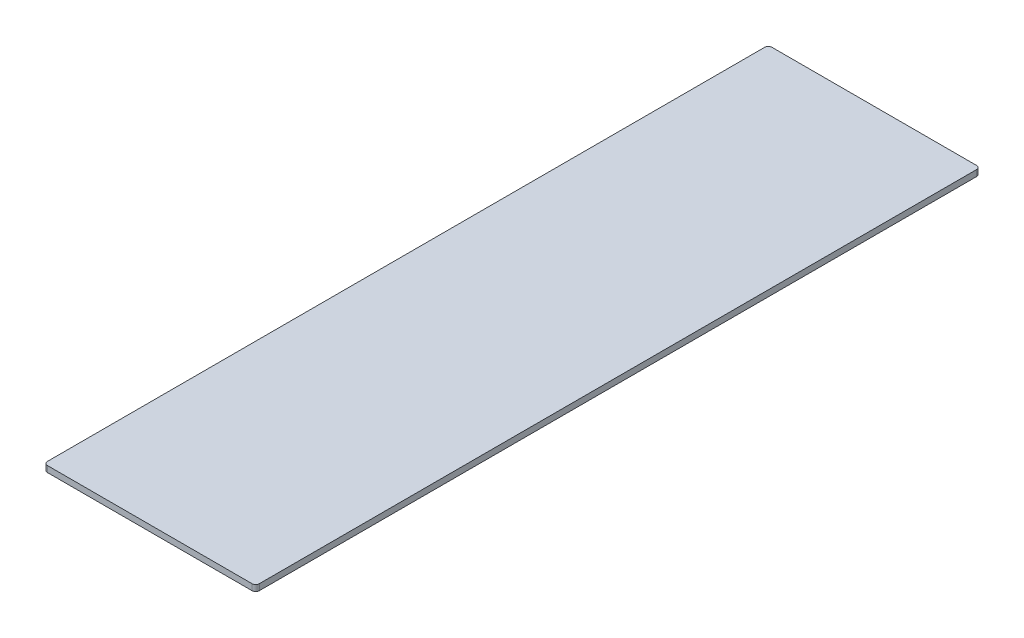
ISO-10303-21;
HEADER;
FILE_DESCRIPTION(('STEP AP214'),'2;1');
FILE_NAME('part.step','',(''),(''),'','','');
FILE_SCHEMA(('AUTOMOTIVE_DESIGN { 1 0 10303 214 1 1 1 1 }'));
ENDSEC;
DATA;
#1=APPLICATION_CONTEXT('core data for automotive mechanical design processes');
#2=APPLICATION_PROTOCOL_DEFINITION('international standard','automotive_design',2000,#1);
#3=PRODUCT_CONTEXT('',#1,'mechanical');
#4=PRODUCT('Part','Part','',(#3));
#5=PRODUCT_RELATED_PRODUCT_CATEGORY('part','',(#4));
#6=PRODUCT_DEFINITION_FORMATION('','',#4);
#7=PRODUCT_DEFINITION_CONTEXT('part definition',#1,'design');
#8=PRODUCT_DEFINITION('design','',#6,#7);
#9=PRODUCT_DEFINITION_SHAPE('','',#8);
#10=(LENGTH_UNIT() NAMED_UNIT(*) SI_UNIT(.MILLI.,.METRE.));
#11=(NAMED_UNIT(*) PLANE_ANGLE_UNIT() SI_UNIT($,.RADIAN.));
#12=(NAMED_UNIT(*) SI_UNIT($,.STERADIAN.) SOLID_ANGLE_UNIT());
#13=UNCERTAINTY_MEASURE_WITH_UNIT(LENGTH_MEASURE(1.E-05),#10,'distance_accuracy_value','');
#14=(GEOMETRIC_REPRESENTATION_CONTEXT(3) GLOBAL_UNCERTAINTY_ASSIGNED_CONTEXT((#13)) GLOBAL_UNIT_ASSIGNED_CONTEXT((#10,
#11,#12)) REPRESENTATION_CONTEXT('',''));
#15=CARTESIAN_POINT('',(0.,0.,0.));
#16=DIRECTION('',(0.,0.,1.));
#17=DIRECTION('',(1.,0.,0.));
#18=AXIS2_PLACEMENT_3D('',#15,#16,#17);
#19=CARTESIAN_POINT('',(-86.7,-5.,296.5));
#20=DIRECTION('',(-1.,0.,0.));
#21=DIRECTION('',(0.,0.,1.));
#22=AXIS2_PLACEMENT_3D('',#19,#20,#21);
#23=PLANE('',#22);
#24=DIRECTION('',(0.,0.,1.));
#25=VECTOR('',#24,1.);
#26=CARTESIAN_POINT('',(-86.7,0.,296.5));
#27=LINE('',#26,#25);
#28=CARTESIAN_POINT('',(-86.7,0.,-293.5));
#29=VERTEX_POINT('',#28);
#30=CARTESIAN_POINT('',(-86.7,0.,293.5));
#31=VERTEX_POINT('',#30);
#32=EDGE_CURVE('E158',#29,#31,#27,.T.);
#33=ORIENTED_EDGE('',*,*,#32,.F.);
#34=DIRECTION('',(0.,1.,0.));
#35=VECTOR('',#34,1.);
#36=CARTESIAN_POINT('',(-86.7,-5.,-293.5));
#37=LINE('',#36,#35);
#38=CARTESIAN_POINT('',(-86.7,-5.,-293.5));
#39=VERTEX_POINT('',#38);
#40=EDGE_CURVE('E148',#29,#39,#37,.F.);
#41=ORIENTED_EDGE('',*,*,#40,.T.);
#42=DIRECTION('',(0.,0.,1.));
#43=VECTOR('',#42,1.);
#44=CARTESIAN_POINT('',(-86.7,-5.,296.5));
#45=LINE('',#44,#43);
#46=CARTESIAN_POINT('',(-86.7,-5.,293.5));
#47=VERTEX_POINT('',#46);
#48=EDGE_CURVE('E152',#39,#47,#45,.T.);
#49=ORIENTED_EDGE('',*,*,#48,.T.);
#50=DIRECTION('',(0.,1.,0.));
#51=VECTOR('',#50,1.);
#52=CARTESIAN_POINT('',(-86.7,-5.,293.5));
#53=LINE('',#52,#51);
#54=EDGE_CURVE('E145',#47,#31,#53,.T.);
#55=ORIENTED_EDGE('',*,*,#54,.T.);
#56=EDGE_LOOP('',(#33,#41,#49,#55));
#57=FACE_BOUND('',#56,.T.);
#58=ADVANCED_FACE('F35',(#57),#23,.T.);
#59=CARTESIAN_POINT('',(86.7,-5.,-296.5));
#60=DIRECTION('',(0.,0.,-1.));
#61=DIRECTION('',(-1.,0.,0.));
#62=AXIS2_PLACEMENT_3D('',#59,#60,#61);
#63=PLANE('',#62);
#64=DIRECTION('',(-1.,0.,0.));
#65=VECTOR('',#64,1.);
#66=CARTESIAN_POINT('',(86.7,0.,-296.5));
#67=LINE('',#66,#65);
#68=CARTESIAN_POINT('',(83.7,0.,-296.5));
#69=VERTEX_POINT('',#68);
#70=CARTESIAN_POINT('',(-83.7,0.,-296.5));
#71=VERTEX_POINT('',#70);
#72=EDGE_CURVE('E118',#69,#71,#67,.T.);
#73=ORIENTED_EDGE('',*,*,#72,.F.);
#74=DIRECTION('',(0.,1.,0.));
#75=VECTOR('',#74,1.);
#76=CARTESIAN_POINT('',(83.7,-5.,-296.5));
#77=LINE('',#76,#75);
#78=CARTESIAN_POINT('',(83.7,-5.,-296.5));
#79=VERTEX_POINT('',#78);
#80=EDGE_CURVE('E136',#69,#79,#77,.F.);
#81=ORIENTED_EDGE('',*,*,#80,.T.);
#82=DIRECTION('',(-1.,0.,0.));
#83=VECTOR('',#82,1.);
#84=CARTESIAN_POINT('',(86.7,-5.,-296.5));
#85=LINE('',#84,#83);
#86=CARTESIAN_POINT('',(-83.7,-5.,-296.5));
#87=VERTEX_POINT('',#86);
#88=EDGE_CURVE('E120',#79,#87,#85,.T.);
#89=ORIENTED_EDGE('',*,*,#88,.T.);
#90=DIRECTION('',(0.,1.,0.));
#91=VECTOR('',#90,1.);
#92=CARTESIAN_POINT('',(-83.7,-5.,-296.5));
#93=LINE('',#92,#91);
#94=EDGE_CURVE('E133',#87,#71,#93,.T.);
#95=ORIENTED_EDGE('',*,*,#94,.T.);
#96=EDGE_LOOP('',(#73,#81,#89,#95));
#97=FACE_BOUND('',#96,.T.);
#98=ADVANCED_FACE('F176',(#97),#63,.T.);
#99=CARTESIAN_POINT('',(86.7,-5.,296.5));
#100=DIRECTION('',(1.,0.,0.));
#101=DIRECTION('',(0.,0.,-1.));
#102=AXIS2_PLACEMENT_3D('',#99,#100,#101);
#103=PLANE('',#102);
#104=DIRECTION('',(0.,0.,-1.));
#105=VECTOR('',#104,1.);
#106=CARTESIAN_POINT('',(86.7,-5.,296.5));
#107=LINE('',#106,#105);
#108=CARTESIAN_POINT('',(86.7,-5.,293.5));
#109=VERTEX_POINT('',#108);
#110=CARTESIAN_POINT('',(86.7,-5.,-293.5));
#111=VERTEX_POINT('',#110);
#112=EDGE_CURVE('E124',#109,#111,#107,.T.);
#113=ORIENTED_EDGE('',*,*,#112,.T.);
#114=DIRECTION('',(0.,1.,0.));
#115=VECTOR('',#114,1.);
#116=CARTESIAN_POINT('',(86.7,-5.,-293.5));
#117=LINE('',#116,#115);
#118=CARTESIAN_POINT('',(86.7,0.,-293.5));
#119=VERTEX_POINT('',#118);
#120=EDGE_CURVE('E110',#111,#119,#117,.T.);
#121=ORIENTED_EDGE('',*,*,#120,.T.);
#122=DIRECTION('',(0.,0.,-1.));
#123=VECTOR('',#122,1.);
#124=CARTESIAN_POINT('',(86.7,0.,296.5));
#125=LINE('',#124,#123);
#126=CARTESIAN_POINT('',(86.7,0.,293.5));
#127=VERTEX_POINT('',#126);
#128=EDGE_CURVE('E103',#127,#119,#125,.T.);
#129=ORIENTED_EDGE('',*,*,#128,.F.);
#130=DIRECTION('',(0.,1.,0.));
#131=VECTOR('',#130,1.);
#132=CARTESIAN_POINT('',(86.7,-5.,293.5));
#133=LINE('',#132,#131);
#134=EDGE_CURVE('E116',#127,#109,#133,.F.);
#135=ORIENTED_EDGE('',*,*,#134,.T.);
#136=EDGE_LOOP('',(#113,#121,#129,#135));
#137=FACE_BOUND('',#136,.T.);
#138=ADVANCED_FACE('F115',(#137),#103,.T.);
#139=CARTESIAN_POINT('',(86.7,-5.,296.5));
#140=DIRECTION('',(0.,0.,1.));
#141=DIRECTION('',(1.,0.,0.));
#142=AXIS2_PLACEMENT_3D('',#139,#140,#141);
#143=PLANE('',#142);
#144=DIRECTION('',(1.,0.,0.));
#145=VECTOR('',#144,1.);
#146=CARTESIAN_POINT('',(86.7,0.,296.5));
#147=LINE('',#146,#145);
#148=CARTESIAN_POINT('',(-83.7,0.,296.5));
#149=VERTEX_POINT('',#148);
#150=CARTESIAN_POINT('',(83.7,0.,296.5));
#151=VERTEX_POINT('',#150);
#152=EDGE_CURVE('E104',#149,#151,#147,.T.);
#153=ORIENTED_EDGE('',*,*,#152,.F.);
#154=DIRECTION('',(0.,1.,0.));
#155=VECTOR('',#154,1.);
#156=CARTESIAN_POINT('',(-83.7,-5.,296.5));
#157=LINE('',#156,#155);
#158=CARTESIAN_POINT('',(-83.7,-5.,296.5));
#159=VERTEX_POINT('',#158);
#160=EDGE_CURVE('E11',#149,#159,#157,.F.);
#161=ORIENTED_EDGE('',*,*,#160,.T.);
#162=DIRECTION('',(1.,0.,0.));
#163=VECTOR('',#162,1.);
#164=CARTESIAN_POINT('',(86.7,-5.,296.5));
#165=LINE('',#164,#163);
#166=CARTESIAN_POINT('',(83.7,-5.,296.5));
#167=VERTEX_POINT('',#166);
#168=EDGE_CURVE('E150',#159,#167,#165,.T.);
#169=ORIENTED_EDGE('',*,*,#168,.T.);
#170=DIRECTION('',(0.,1.,0.));
#171=VECTOR('',#170,1.);
#172=CARTESIAN_POINT('',(83.7,-5.,296.5));
#173=LINE('',#172,#171);
#174=EDGE_CURVE('E43',#167,#151,#173,.T.);
#175=ORIENTED_EDGE('',*,*,#174,.T.);
#176=EDGE_LOOP('',(#153,#161,#169,#175));
#177=FACE_BOUND('',#176,.T.);
#178=ADVANCED_FACE('F149',(#177),#143,.T.);
#179=CARTESIAN_POINT('',(0.,-5.,0.));
#180=DIRECTION('',(0.,1.,0.));
#181=DIRECTION('',(0.,0.,1.));
#182=AXIS2_PLACEMENT_3D('',#179,#180,#181);
#183=PLANE('',#182);
#184=ORIENTED_EDGE('',*,*,#88,.F.);
#185=CARTESIAN_POINT('',(83.7,-5.,-293.5));
#186=DIRECTION('',(0.,1.,0.));
#187=DIRECTION('',(0.,0.,1.));
#188=AXIS2_PLACEMENT_3D('',#185,#186,#187);
#189=CIRCLE('',#188,3.);
#190=EDGE_CURVE('E143',#79,#111,#189,.F.);
#191=ORIENTED_EDGE('',*,*,#190,.T.);
#192=ORIENTED_EDGE('',*,*,#112,.F.);
#193=CARTESIAN_POINT('',(83.7,-5.,293.5));
#194=DIRECTION('',(0.,1.,0.));
#195=DIRECTION('',(0.,0.,1.));
#196=AXIS2_PLACEMENT_3D('',#193,#194,#195);
#197=CIRCLE('',#196,3.);
#198=EDGE_CURVE('E50',#109,#167,#197,.F.);
#199=ORIENTED_EDGE('',*,*,#198,.T.);
#200=ORIENTED_EDGE('',*,*,#168,.F.);
#201=CARTESIAN_POINT('',(-83.7,-5.,293.5));
#202=DIRECTION('',(0.,1.,0.));
#203=DIRECTION('',(0.,0.,1.));
#204=AXIS2_PLACEMENT_3D('',#201,#202,#203);
#205=CIRCLE('',#204,3.);
#206=EDGE_CURVE('E139',#159,#47,#205,.F.);
#207=ORIENTED_EDGE('',*,*,#206,.T.);
#208=ORIENTED_EDGE('',*,*,#48,.F.);
#209=CARTESIAN_POINT('',(-83.7,-5.,-293.5));
#210=DIRECTION('',(0.,1.,0.));
#211=DIRECTION('',(0.,0.,1.));
#212=AXIS2_PLACEMENT_3D('',#209,#210,#211);
#213=CIRCLE('',#212,3.);
#214=EDGE_CURVE('E141',#39,#87,#213,.F.);
#215=ORIENTED_EDGE('',*,*,#214,.T.);
#216=EDGE_LOOP('',(#184,#191,#192,#199,#200,#207,#208,#215));
#217=FACE_BOUND('',#216,.T.);
#218=ADVANCED_FACE('F172',(#217),#183,.F.);
#219=CARTESIAN_POINT('',(0.,0.,0.));
#220=DIRECTION('',(0.,1.,0.));
#221=DIRECTION('',(0.,0.,1.));
#222=AXIS2_PLACEMENT_3D('',#219,#220,#221);
#223=PLANE('',#222);
#224=ORIENTED_EDGE('',*,*,#128,.T.);
#225=CARTESIAN_POINT('',(83.7,0.,-293.5));
#226=DIRECTION('',(0.,1.,0.));
#227=DIRECTION('',(0.,0.,1.));
#228=AXIS2_PLACEMENT_3D('',#225,#226,#227);
#229=CIRCLE('',#228,3.);
#230=EDGE_CURVE('E131',#119,#69,#229,.T.);
#231=ORIENTED_EDGE('',*,*,#230,.T.);
#232=ORIENTED_EDGE('',*,*,#72,.T.);
#233=CARTESIAN_POINT('',(-83.7,0.,-293.5));
#234=DIRECTION('',(0.,1.,0.));
#235=DIRECTION('',(0.,0.,1.));
#236=AXIS2_PLACEMENT_3D('',#233,#234,#235);
#237=CIRCLE('',#236,3.);
#238=EDGE_CURVE('E129',#71,#29,#237,.T.);
#239=ORIENTED_EDGE('',*,*,#238,.T.);
#240=ORIENTED_EDGE('',*,*,#32,.T.);
#241=CARTESIAN_POINT('',(-83.7,0.,293.5));
#242=DIRECTION('',(0.,1.,0.));
#243=DIRECTION('',(0.,0.,1.));
#244=AXIS2_PLACEMENT_3D('',#241,#242,#243);
#245=CIRCLE('',#244,3.);
#246=EDGE_CURVE('E109',#31,#149,#245,.T.);
#247=ORIENTED_EDGE('',*,*,#246,.T.);
#248=ORIENTED_EDGE('',*,*,#152,.T.);
#249=CARTESIAN_POINT('',(83.7,0.,293.5));
#250=DIRECTION('',(0.,1.,0.));
#251=DIRECTION('',(0.,0.,1.));
#252=AXIS2_PLACEMENT_3D('',#249,#250,#251);
#253=CIRCLE('',#252,3.);
#254=EDGE_CURVE('E100',#151,#127,#253,.T.);
#255=ORIENTED_EDGE('',*,*,#254,.T.);
#256=EDGE_LOOP('',(#224,#231,#232,#239,#240,#247,#248,#255));
#257=FACE_BOUND('',#256,.T.);
#258=ADVANCED_FACE('F102',(#257),#223,.T.);
#259=CARTESIAN_POINT('',(83.7,-5.,-293.5));
#260=DIRECTION('',(0.,1.,0.));
#261=DIRECTION('',(0.,0.,1.));
#262=AXIS2_PLACEMENT_3D('',#259,#260,#261);
#263=CYLINDRICAL_SURFACE('',#262,3.);
#264=ORIENTED_EDGE('',*,*,#190,.F.);
#265=ORIENTED_EDGE('',*,*,#80,.F.);
#266=ORIENTED_EDGE('',*,*,#230,.F.);
#267=ORIENTED_EDGE('',*,*,#120,.F.);
#268=EDGE_LOOP('',(#264,#265,#266,#267));
#269=FACE_BOUND('',#268,.T.);
#270=ADVANCED_FACE('F179',(#269),#263,.T.);
#271=CARTESIAN_POINT('',(-83.7,-5.,-293.5));
#272=DIRECTION('',(0.,1.,0.));
#273=DIRECTION('',(0.,0.,1.));
#274=AXIS2_PLACEMENT_3D('',#271,#272,#273);
#275=CYLINDRICAL_SURFACE('',#274,3.);
#276=ORIENTED_EDGE('',*,*,#214,.F.);
#277=ORIENTED_EDGE('',*,*,#40,.F.);
#278=ORIENTED_EDGE('',*,*,#238,.F.);
#279=ORIENTED_EDGE('',*,*,#94,.F.);
#280=EDGE_LOOP('',(#276,#277,#278,#279));
#281=FACE_BOUND('',#280,.T.);
#282=ADVANCED_FACE('F169',(#281),#275,.T.);
#283=CARTESIAN_POINT('',(-83.7,-5.,293.5));
#284=DIRECTION('',(0.,1.,0.));
#285=DIRECTION('',(0.,0.,1.));
#286=AXIS2_PLACEMENT_3D('',#283,#284,#285);
#287=CYLINDRICAL_SURFACE('',#286,3.);
#288=ORIENTED_EDGE('',*,*,#206,.F.);
#289=ORIENTED_EDGE('',*,*,#160,.F.);
#290=ORIENTED_EDGE('',*,*,#246,.F.);
#291=ORIENTED_EDGE('',*,*,#54,.F.);
#292=EDGE_LOOP('',(#288,#289,#290,#291));
#293=FACE_BOUND('',#292,.T.);
#294=ADVANCED_FACE('F186',(#293),#287,.T.);
#295=CARTESIAN_POINT('',(83.7,-5.,293.5));
#296=DIRECTION('',(0.,1.,0.));
#297=DIRECTION('',(0.,0.,1.));
#298=AXIS2_PLACEMENT_3D('',#295,#296,#297);
#299=CYLINDRICAL_SURFACE('',#298,3.);
#300=ORIENTED_EDGE('',*,*,#198,.F.);
#301=ORIENTED_EDGE('',*,*,#134,.F.);
#302=ORIENTED_EDGE('',*,*,#254,.F.);
#303=ORIENTED_EDGE('',*,*,#174,.F.);
#304=EDGE_LOOP('',(#300,#301,#302,#303));
#305=FACE_BOUND('',#304,.T.);
#306=ADVANCED_FACE('F37',(#305),#299,.T.);
#307=CLOSED_SHELL('',(#58,#98,#138,#178,#218,#258,#270,#282,#294,#306));
#308=MANIFOLD_SOLID_BREP('B2',#307);
#309=ADVANCED_BREP_SHAPE_REPRESENTATION('',(#18,#308),#14);
#310=SHAPE_DEFINITION_REPRESENTATION(#9,#309);
ENDSEC;
END-ISO-10303-21;
